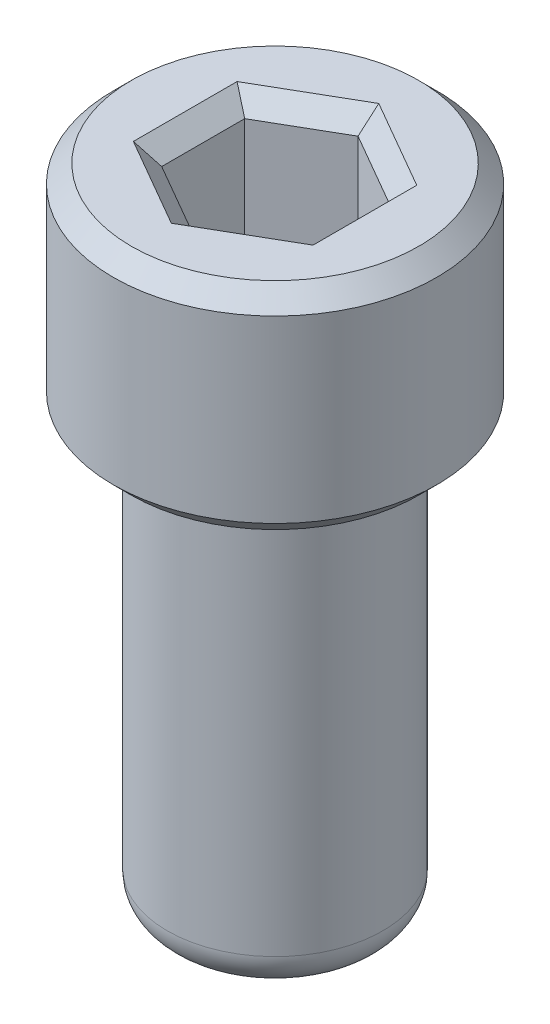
from build123d import *

# Parameters (mm, degrees)
SKETCH1_R           = 1.5
BOSS_EXTRUDE1_DEPTH = 6
SKETCH2_R           = 2.25
BOSS_EXTRUDE2_DEPTH = 3
CUT_EXTRUDE1_DEPTH  = 2
CHAMFER1_SIZE       = 0.25
FILLET1_R           = 0.5


with BuildPart() as part:
    # Sketch1 → Boss-Extrude1 (new body)
    with BuildSketch(Plane(origin=(0, 0, 0), x_dir=(1, 0, 0), z_dir=(0, 1, 0))):
        with Locations(Location((0, 0, 0), (0, 0, 270))):
            Circle(SKETCH1_R)
    extrude(amount=BOSS_EXTRUDE1_DEPTH)

    # Sketch2 → Boss-Extrude2 (add)
    with BuildSketch(Plane(origin=(0, 6, 0), x_dir=(1, 0, 0), z_dir=(0, 1, 0))):
        with Locations(Location((0, 0, 0), (0, 0, 270))):
            Circle(SKETCH2_R)
    extrude(amount=BOSS_EXTRUDE2_DEPTH)

    # Sketch3 → Cut-Extrude1 (cut)
    with BuildSketch(Plane(origin=(0, 9, 0), x_dir=(1, 0, 0), z_dir=(0, 1, 0))):
        Polygon((0, 1.154700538), (-1, 0.577350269), (-1, -0.577350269), (0, -1.154700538), (1, -0.577350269), (1, 0.577350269), align=None)
    extrude(amount=-CUT_EXTRUDE1_DEPTH, mode=Mode.SUBTRACT)

    # Chamfer1
    chamfer1_edges = [part.edges().sort_by_distance(p)[0] for p in [
        (0.5, 9, -0.866025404),
        (-0.5, 9, -0.866025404),
        (-1, 9, 0),
        (-0.5, 9, 0.866025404),
        (0.5, 9, 0.866025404),
        (1, 9, 0),
        (0, 6, -2.25),
        (0, 9, -2.25),
    ]]
    chamfer(chamfer1_edges, length=CHAMFER1_SIZE)

    # Fillet1
    fillet1_edges = [part.edges().sort_by_distance(p)[0] for p in [
        (0, 0, -1.5),
    ]]
    fillet(fillet1_edges, radius=FILLET1_R)


solid = part.part
